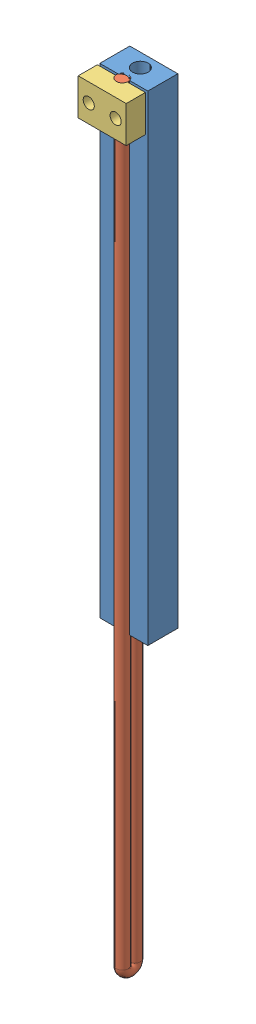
SolidWorks assembly Assem1.sldasm, configuration Default (file format 3400). Lengths in mm.
Overall size (12.7 206.38 13.65).
3 component instances, 3 part files, 5 mates.
Components (placement in the parent):
- GHM-8235 INTERNAL RESERVOIR BAR-1: GHM-8235 INTERNAL RESERVOIR BAR.SLDPRT [Default] at (21.7542 -18.0337 58.1765) size (12.7 127 7.94)
- GHM-8235 INTERNAL RESERVOIR BENT ROD-1: GHM-8235 INTERNAL RESERVOIR BENT ROD.SLDPRT [Default] at (28.1042 108.9663 58.5575) x (0 -1 0) z (0 0 1) size (206.38 3.17 6.35)
- GHM-8245 INTERNAL RESERVOIR SPLIT CLAMP-1: GHM-8245 INTERNAL RESERVOIR SPLIT CLAMP.SLDPRT [Default] at (21.7542 108.9663 58.8115) x (1 0 0) z (0 0 -1) size (12.7 9.65 5.08)
Mates (geometry in assembly coordinates):
- Concentric1: concentric anti-aligned: circle of ?; circle of ?
- Concentric2: concentric aligned: circle of ?; circle of ?
- Concentric3: concentric aligned: circle of ?; circle of ?
- Coincident1: coincident anti-aligned: plane of ?; circle of ?
- Concentric4: concentric aligned: cylinder of ?; cylinder of ?
